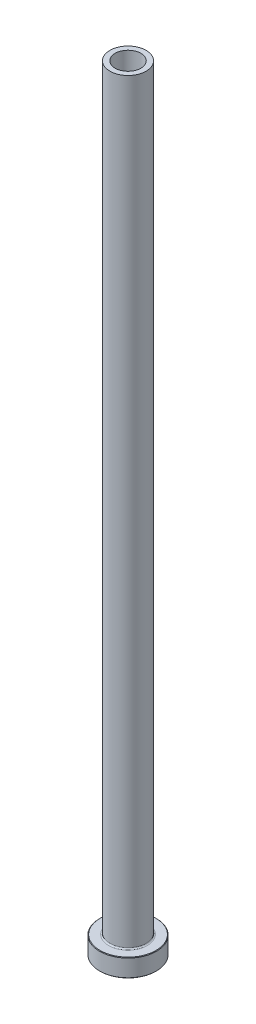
ISO-10303-21;
HEADER;
FILE_DESCRIPTION(('STEP AP214'),'2;1');
FILE_NAME('part.step','',(''),(''),'','','');
FILE_SCHEMA(('AUTOMOTIVE_DESIGN { 1 0 10303 214 1 1 1 1 }'));
ENDSEC;
DATA;
#1=APPLICATION_CONTEXT('core data for automotive mechanical design processes');
#2=APPLICATION_PROTOCOL_DEFINITION('international standard','automotive_design',2000,#1);
#3=PRODUCT_CONTEXT('',#1,'mechanical');
#4=PRODUCT('Part','Part','',(#3));
#5=PRODUCT_RELATED_PRODUCT_CATEGORY('part','',(#4));
#6=PRODUCT_DEFINITION_FORMATION('','',#4);
#7=PRODUCT_DEFINITION_CONTEXT('part definition',#1,'design');
#8=PRODUCT_DEFINITION('design','',#6,#7);
#9=PRODUCT_DEFINITION_SHAPE('','',#8);
#10=(LENGTH_UNIT() NAMED_UNIT(*) SI_UNIT(.MILLI.,.METRE.));
#11=(NAMED_UNIT(*) PLANE_ANGLE_UNIT() SI_UNIT($,.RADIAN.));
#12=(NAMED_UNIT(*) SI_UNIT($,.STERADIAN.) SOLID_ANGLE_UNIT());
#13=UNCERTAINTY_MEASURE_WITH_UNIT(LENGTH_MEASURE(1.E-05),#10,'distance_accuracy_value','');
#14=(GEOMETRIC_REPRESENTATION_CONTEXT(3) GLOBAL_UNCERTAINTY_ASSIGNED_CONTEXT((#13)) GLOBAL_UNIT_ASSIGNED_CONTEXT((#10,
#11,#12)) REPRESENTATION_CONTEXT('',''));
#15=CARTESIAN_POINT('',(0.,0.,0.));
#16=DIRECTION('',(0.,0.,1.));
#17=DIRECTION('',(1.,0.,0.));
#18=AXIS2_PLACEMENT_3D('',#15,#16,#17);
#19=CARTESIAN_POINT('',(0.,92.1876809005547,0.));
#20=DIRECTION('',(0.,1.,0.));
#21=DIRECTION('',(0.,0.,1.));
#22=AXIS2_PLACEMENT_3D('',#19,#20,#21);
#23=CYLINDRICAL_SURFACE('',#22,5.00000000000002);
#24=CARTESIAN_POINT('',(0.,300.,0.));
#25=DIRECTION('',(0.,1.,0.));
#26=DIRECTION('',(0.,0.,1.));
#27=AXIS2_PLACEMENT_3D('',#24,#25,#26);
#28=CIRCLE('',#27,5.00000000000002);
#29=CARTESIAN_POINT('',(0.,300.,5.00000000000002));
#30=VERTEX_POINT('',#29);
#31=EDGE_CURVE('E62',#30,#30,#28,.T.);
#32=ORIENTED_EDGE('',*,*,#31,.T.);
#33=EDGE_LOOP('',(#32));
#34=FACE_BOUND('',#33,.T.);
#35=CARTESIAN_POINT('',(0.,255.,0.));
#36=DIRECTION('',(0.,1.,0.));
#37=DIRECTION('',(0.,0.,1.));
#38=AXIS2_PLACEMENT_3D('',#35,#36,#37);
#39=CIRCLE('',#38,5.00000000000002);
#40=CARTESIAN_POINT('',(0.,255.,5.00000000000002));
#41=VERTEX_POINT('',#40);
#42=EDGE_CURVE('E71',#41,#41,#39,.T.);
#43=ORIENTED_EDGE('',*,*,#42,.F.);
#44=EDGE_LOOP('',(#43));
#45=FACE_BOUND('',#44,.T.);
#46=ADVANCED_FACE('F30',(#34,#45),#23,.F.);
#47=CARTESIAN_POINT('',(-5.00000000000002,300.,0.));
#48=DIRECTION('',(0.,1.,0.));
#49=DIRECTION('',(0.,0.,1.));
#50=AXIS2_PLACEMENT_3D('',#47,#48,#49);
#51=PLANE('',#50);
#52=CARTESIAN_POINT('',(0.,300.,0.));
#53=DIRECTION('',(0.,1.,0.));
#54=DIRECTION('',(0.,0.,1.));
#55=AXIS2_PLACEMENT_3D('',#52,#53,#54);
#56=CIRCLE('',#55,7.00000000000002);
#57=CARTESIAN_POINT('',(0.,300.,7.00000000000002));
#58=VERTEX_POINT('',#57);
#59=EDGE_CURVE('E65',#58,#58,#56,.T.);
#60=ORIENTED_EDGE('',*,*,#59,.T.);
#61=EDGE_LOOP('',(#60));
#62=FACE_BOUND('',#61,.T.);
#63=ORIENTED_EDGE('',*,*,#31,.F.);
#64=EDGE_LOOP('',(#63));
#65=FACE_BOUND('',#64,.T.);
#66=ADVANCED_FACE('F79',(#62,#65),#51,.T.);
#67=CARTESIAN_POINT('',(0.,92.1876809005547,0.));
#68=DIRECTION('',(0.,1.,0.));
#69=DIRECTION('',(0.,0.,1.));
#70=AXIS2_PLACEMENT_3D('',#67,#68,#69);
#71=CYLINDRICAL_SURFACE('',#70,7.00000000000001);
#72=CARTESIAN_POINT('',(0.,7.50000000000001,0.));
#73=DIRECTION('',(0.,1.,0.));
#74=DIRECTION('',(0.,0.,1.));
#75=AXIS2_PLACEMENT_3D('',#72,#73,#74);
#76=CIRCLE('',#75,7.00000000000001);
#77=CARTESIAN_POINT('',(0.,7.50000000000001,7.00000000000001));
#78=VERTEX_POINT('',#77);
#79=EDGE_CURVE('E59',#78,#78,#76,.T.);
#80=ORIENTED_EDGE('',*,*,#79,.T.);
#81=EDGE_LOOP('',(#80));
#82=FACE_BOUND('',#81,.T.);
#83=ORIENTED_EDGE('',*,*,#59,.F.);
#84=EDGE_LOOP('',(#83));
#85=FACE_BOUND('',#84,.T.);
#86=ADVANCED_FACE('F85',(#82,#85),#71,.T.);
#87=CARTESIAN_POINT('',(-6.99999999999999,7.,0.));
#88=DIRECTION('',(0.,1.,0.));
#89=DIRECTION('',(0.,0.,1.));
#90=AXIS2_PLACEMENT_3D('',#87,#88,#89);
#91=PLANE('',#90);
#92=CARTESIAN_POINT('',(0.,7.,0.));
#93=DIRECTION('',(0.,1.,0.));
#94=DIRECTION('',(0.,0.,1.));
#95=AXIS2_PLACEMENT_3D('',#92,#93,#94);
#96=CIRCLE('',#95,10.8);
#97=CARTESIAN_POINT('',(0.,7.,-10.8));
#98=VERTEX_POINT('',#97);
#99=EDGE_CURVE('E53',#98,#98,#96,.T.);
#100=ORIENTED_EDGE('',*,*,#99,.T.);
#101=EDGE_LOOP('',(#100));
#102=FACE_BOUND('',#101,.T.);
#103=CARTESIAN_POINT('',(0.,7.,0.));
#104=DIRECTION('',(0.,1.,0.));
#105=DIRECTION('',(0.,0.,1.));
#106=AXIS2_PLACEMENT_3D('',#103,#104,#105);
#107=CIRCLE('',#106,7.50000000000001);
#108=CARTESIAN_POINT('',(0.,7.,7.50000000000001));
#109=VERTEX_POINT('',#108);
#110=EDGE_CURVE('E56',#109,#109,#107,.F.);
#111=ORIENTED_EDGE('',*,*,#110,.T.);
#112=EDGE_LOOP('',(#111));
#113=FACE_BOUND('',#112,.T.);
#114=ADVANCED_FACE('F111',(#102,#113),#91,.T.);
#115=CARTESIAN_POINT('',(0.,92.1876809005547,0.));
#116=DIRECTION('',(0.,1.,0.));
#117=DIRECTION('',(0.,0.,1.));
#118=AXIS2_PLACEMENT_3D('',#115,#116,#117);
#119=CYLINDRICAL_SURFACE('',#118,11.);
#120=CARTESIAN_POINT('',(0.,6.80000000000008,0.));
#121=DIRECTION('',(0.,1.,0.));
#122=DIRECTION('',(0.,0.,1.));
#123=AXIS2_PLACEMENT_3D('',#120,#121,#122);
#124=CIRCLE('',#123,11.);
#125=CARTESIAN_POINT('',(0.,6.80000000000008,-11.));
#126=VERTEX_POINT('',#125);
#127=EDGE_CURVE('E45',#126,#126,#124,.F.);
#128=ORIENTED_EDGE('',*,*,#127,.T.);
#129=EDGE_LOOP('',(#128));
#130=FACE_BOUND('',#129,.T.);
#131=CARTESIAN_POINT('',(0.,0.200000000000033,0.));
#132=DIRECTION('',(0.,-1.,0.));
#133=DIRECTION('',(0.,0.,-1.));
#134=AXIS2_PLACEMENT_3D('',#131,#132,#133);
#135=CIRCLE('',#134,11.);
#136=CARTESIAN_POINT('',(0.,0.200000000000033,-11.));
#137=VERTEX_POINT('',#136);
#138=EDGE_CURVE('E50',#137,#137,#135,.F.);
#139=ORIENTED_EDGE('',*,*,#138,.T.);
#140=EDGE_LOOP('',(#139));
#141=FACE_BOUND('',#140,.T.);
#142=ADVANCED_FACE('F108',(#130,#141),#119,.T.);
#143=CARTESIAN_POINT('',(-11.,0.,0.));
#144=DIRECTION('',(0.,-1.,0.));
#145=DIRECTION('',(0.,0.,-1.));
#146=AXIS2_PLACEMENT_3D('',#143,#144,#145);
#147=PLANE('',#146);
#148=CARTESIAN_POINT('',(0.,0.,0.));
#149=DIRECTION('',(0.,-1.,0.));
#150=DIRECTION('',(0.,0.,-1.));
#151=AXIS2_PLACEMENT_3D('',#148,#149,#150);
#152=CIRCLE('',#151,5.75000000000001);
#153=CARTESIAN_POINT('',(0.,0.,-5.75000000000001));
#154=VERTEX_POINT('',#153);
#155=EDGE_CURVE('E37',#154,#154,#152,.F.);
#156=ORIENTED_EDGE('',*,*,#155,.T.);
#157=EDGE_LOOP('',(#156));
#158=FACE_BOUND('',#157,.T.);
#159=CARTESIAN_POINT('',(0.,0.,0.));
#160=DIRECTION('',(0.,-1.,0.));
#161=DIRECTION('',(0.,0.,-1.));
#162=AXIS2_PLACEMENT_3D('',#159,#160,#161);
#163=CIRCLE('',#162,10.8);
#164=CARTESIAN_POINT('',(0.,0.,-10.8));
#165=VERTEX_POINT('',#164);
#166=EDGE_CURVE('E41',#165,#165,#163,.T.);
#167=ORIENTED_EDGE('',*,*,#166,.T.);
#168=EDGE_LOOP('',(#167));
#169=FACE_BOUND('',#168,.T.);
#170=ADVANCED_FACE('F110',(#158,#169),#147,.T.);
#171=CARTESIAN_POINT('',(0.,92.1876809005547,0.));
#172=DIRECTION('',(0.,1.,0.));
#173=DIRECTION('',(0.,0.,1.));
#174=AXIS2_PLACEMENT_3D('',#171,#172,#173);
#175=CYLINDRICAL_SURFACE('',#174,5.25000000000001);
#176=CARTESIAN_POINT('',(0.,0.499999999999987,0.));
#177=DIRECTION('',(0.,-1.,0.));
#178=DIRECTION('',(0.,0.,-1.));
#179=AXIS2_PLACEMENT_3D('',#176,#177,#178);
#180=CIRCLE('',#179,5.25000000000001);
#181=CARTESIAN_POINT('',(0.,0.499999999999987,-5.25000000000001));
#182=VERTEX_POINT('',#181);
#183=EDGE_CURVE('E10',#182,#182,#180,.T.);
#184=ORIENTED_EDGE('',*,*,#183,.T.);
#185=EDGE_LOOP('',(#184));
#186=FACE_BOUND('',#185,.T.);
#187=CARTESIAN_POINT('',(0.,243.,0.));
#188=DIRECTION('',(0.,1.,0.));
#189=DIRECTION('',(0.,0.,1.));
#190=AXIS2_PLACEMENT_3D('',#187,#188,#189);
#191=CIRCLE('',#190,5.25000000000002);
#192=CARTESIAN_POINT('',(0.,243.,5.25000000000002));
#193=VERTEX_POINT('',#192);
#194=EDGE_CURVE('E68',#193,#193,#191,.T.);
#195=ORIENTED_EDGE('',*,*,#194,.T.);
#196=EDGE_LOOP('',(#195));
#197=FACE_BOUND('',#196,.T.);
#198=ADVANCED_FACE('F118',(#186,#197),#175,.F.);
#199=CARTESIAN_POINT('',(0.,243.,0.));
#200=DIRECTION('',(0.,-1.,0.));
#201=DIRECTION('',(0.,0.,-1.));
#202=AXIS2_PLACEMENT_3D('',#199,#200,#201);
#203=CONICAL_SURFACE('',#202,5.25000000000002,0.0208303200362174);
#204=ORIENTED_EDGE('',*,*,#42,.T.);
#205=EDGE_LOOP('',(#204));
#206=FACE_BOUND('',#205,.T.);
#207=ORIENTED_EDGE('',*,*,#194,.F.);
#208=EDGE_LOOP('',(#207));
#209=FACE_BOUND('',#208,.T.);
#210=ADVANCED_FACE('F75',(#206,#209),#203,.F.);
#211=CARTESIAN_POINT('',(0.,7.50000000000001,0.));
#212=DIRECTION('',(0.,1.,0.));
#213=DIRECTION('',(0.,0.,1.));
#214=AXIS2_PLACEMENT_3D('',#211,#212,#213);
#215=TOROIDAL_SURFACE('',#214,7.50000000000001,0.5);
#216=ORIENTED_EDGE('',*,*,#110,.F.);
#217=EDGE_LOOP('',(#216));
#218=FACE_BOUND('',#217,.T.);
#219=ORIENTED_EDGE('',*,*,#79,.F.);
#220=EDGE_LOOP('',(#219));
#221=FACE_BOUND('',#220,.T.);
#222=ADVANCED_FACE('F90',(#218,#221),#215,.F.);
#223=CARTESIAN_POINT('',(0.,7.00000000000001,0.));
#224=DIRECTION('',(0.,-1.,0.));
#225=DIRECTION('',(0.,0.,-1.));
#226=AXIS2_PLACEMENT_3D('',#223,#224,#225);
#227=CONICAL_SURFACE('',#226,10.8,0.785398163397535);
#228=CARTESIAN_POINT('',(0.,6.80000000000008,-11.));
#229=CARTESIAN_POINT('',(0.,6.80208333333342,-10.9979166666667));
#230=CARTESIAN_POINT('',(0.,6.80416666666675,-10.9958333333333));
#231=CARTESIAN_POINT('',(0.,6.80833333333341,-10.9916666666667));
#232=CARTESIAN_POINT('',(0.,6.81041666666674,-10.9895833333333));
#233=CARTESIAN_POINT('',(0.,6.81458333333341,-10.9854166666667));
#234=CARTESIAN_POINT('',(0.,6.81666666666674,-10.9833333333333));
#235=CARTESIAN_POINT('',(0.,6.82083333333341,-10.9791666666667));
#236=CARTESIAN_POINT('',(0.,6.82291666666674,-10.9770833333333));
#237=CARTESIAN_POINT('',(0.,6.82708333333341,-10.9729166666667));
#238=CARTESIAN_POINT('',(0.,6.82916666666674,-10.9708333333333));
#239=CARTESIAN_POINT('',(0.,6.8333333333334,-10.9666666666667));
#240=CARTESIAN_POINT('',(0.,6.83541666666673,-10.9645833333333));
#241=CARTESIAN_POINT('',(0.,6.8395833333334,-10.9604166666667));
#242=CARTESIAN_POINT('',(0.,6.84166666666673,-10.9583333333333));
#243=CARTESIAN_POINT('',(0.,6.8458333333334,-10.9541666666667));
#244=CARTESIAN_POINT('',(0.,6.84791666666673,-10.9520833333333));
#245=CARTESIAN_POINT('',(0.,6.8520833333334,-10.9479166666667));
#246=CARTESIAN_POINT('',(0.,6.85416666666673,-10.9458333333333));
#247=CARTESIAN_POINT('',(0.,6.85833333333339,-10.9416666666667));
#248=CARTESIAN_POINT('',(0.,6.86041666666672,-10.9395833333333));
#249=CARTESIAN_POINT('',(0.,6.86458333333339,-10.9354166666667));
#250=CARTESIAN_POINT('',(0.,6.86666666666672,-10.9333333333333));
#251=CARTESIAN_POINT('',(0.,6.87083333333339,-10.9291666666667));
#252=CARTESIAN_POINT('',(0.,6.87291666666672,-10.9270833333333));
#253=CARTESIAN_POINT('',(0.,6.87708333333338,-10.9229166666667));
#254=CARTESIAN_POINT('',(0.,6.87916666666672,-10.9208333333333));
#255=CARTESIAN_POINT('',(0.,6.88333333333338,-10.9166666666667));
#256=CARTESIAN_POINT('',(0.,6.88541666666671,-10.9145833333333));
#257=CARTESIAN_POINT('',(0.,6.88958333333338,-10.9104166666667));
#258=CARTESIAN_POINT('',(0.,6.89166666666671,-10.9083333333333));
#259=CARTESIAN_POINT('',(0.,6.89583333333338,-10.9041666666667));
#260=CARTESIAN_POINT('',(0.,6.89791666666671,-10.9020833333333));
#261=CARTESIAN_POINT('',(0.,6.90208333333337,-10.8979166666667));
#262=CARTESIAN_POINT('',(0.,6.90416666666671,-10.8958333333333));
#263=CARTESIAN_POINT('',(0.,6.90833333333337,-10.8916666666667));
#264=CARTESIAN_POINT('',(0.,6.9104166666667,-10.8895833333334));
#265=CARTESIAN_POINT('',(0.,6.91458333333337,-10.8854166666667));
#266=CARTESIAN_POINT('',(0.,6.9166666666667,-10.8833333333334));
#267=CARTESIAN_POINT('',(0.,6.92083333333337,-10.8791666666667));
#268=CARTESIAN_POINT('',(0.,6.9229166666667,-10.8770833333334));
#269=CARTESIAN_POINT('',(0.,6.92708333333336,-10.8729166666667));
#270=CARTESIAN_POINT('',(0.,6.9291666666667,-10.8708333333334));
#271=CARTESIAN_POINT('',(0.,6.93333333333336,-10.8666666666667));
#272=CARTESIAN_POINT('',(0.,6.93541666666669,-10.8645833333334));
#273=CARTESIAN_POINT('',(0.,6.93958333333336,-10.8604166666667));
#274=CARTESIAN_POINT('',(0.,6.94166666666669,-10.8583333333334));
#275=CARTESIAN_POINT('',(0.,6.94583333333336,-10.8541666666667));
#276=CARTESIAN_POINT('',(0.,6.94791666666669,-10.8520833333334));
#277=CARTESIAN_POINT('',(0.,6.95208333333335,-10.8479166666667));
#278=CARTESIAN_POINT('',(0.,6.95416666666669,-10.8458333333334));
#279=CARTESIAN_POINT('',(0.,6.95833333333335,-10.8416666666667));
#280=CARTESIAN_POINT('',(0.,6.96041666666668,-10.8395833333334));
#281=CARTESIAN_POINT('',(0.,6.96458333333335,-10.8354166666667));
#282=CARTESIAN_POINT('',(0.,6.96666666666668,-10.8333333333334));
#283=CARTESIAN_POINT('',(0.,6.97083333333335,-10.8291666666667));
#284=CARTESIAN_POINT('',(0.,6.97291666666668,-10.8270833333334));
#285=CARTESIAN_POINT('',(0.,6.97708333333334,-10.8229166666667));
#286=CARTESIAN_POINT('',(0.,6.97916666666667,-10.8208333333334));
#287=CARTESIAN_POINT('',(0.,6.98333333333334,-10.8166666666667));
#288=CARTESIAN_POINT('',(0.,6.98541666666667,-10.8145833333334));
#289=CARTESIAN_POINT('',(0.,6.98958333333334,-10.8104166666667));
#290=CARTESIAN_POINT('',(0.,6.99166666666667,-10.8083333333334));
#291=CARTESIAN_POINT('',(0.,6.99583333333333,-10.8041666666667));
#292=CARTESIAN_POINT('',(0.,6.99791666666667,-10.8020833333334));
#293=CARTESIAN_POINT('',(0.,7.,-10.8));
#294=B_SPLINE_CURVE_WITH_KNOTS('',3,(#228,#229,#230,#231,#232,#233,#234,#235,#236,#237,#238,
#239,#240,#241,#242,#243,#244,#245,#246,#247,#248,#249,#250,#251,#252,#253,#254,#255,#256,#257,
#258,#259,#260,#261,#262,#263,#264,#265,#266,#267,#268,#269,#270,#271,#272,#273,#274,#275,#276,
#277,#278,#279,#280,#281,#282,#283,#284,#285,#286,#287,#288,#289,#290,#291,#292,#293),
.UNSPECIFIED.,.F.,.F.,(4,2,2,2,2,2,2,2,2,2,2,2,2,2,2,2,2,2,2,2,2,2,2,2,2,2,2,2,2,2,2,2,4),(0.,
0.00883883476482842,0.0176776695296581,0.0265165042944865,0.0353553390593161,0.0441941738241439,
0.0530330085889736,0.061871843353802,0.0707106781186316,0.07954951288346,0.0883883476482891,
0.0972271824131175,0.106066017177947,0.114904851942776,0.123743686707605,0.132582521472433,
0.141421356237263,0.150260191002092,0.159099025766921,0.16793786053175,0.176776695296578,
0.185615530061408,0.194454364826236,0.203293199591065,0.212132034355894,0.220970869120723,
0.229809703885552,0.238648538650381,0.247487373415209,0.256326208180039,0.265165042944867,
0.274003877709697,0.282842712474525),.UNSPECIFIED.);
#295=EDGE_CURVE('BSEAM93',#126,#98,#294,.T.);
#296=ORIENTED_EDGE('',*,*,#127,.F.);
#297=ORIENTED_EDGE('',*,*,#99,.F.);
#298=ORIENTED_EDGE('',*,*,#295,.T.);
#299=ORIENTED_EDGE('',*,*,#295,.F.);
#300=EDGE_LOOP('',(#296,#298,#297,#299));
#301=FACE_BOUND('',#300,.T.);
#302=ADVANCED_FACE('F93',(#301),#227,.T.);
#303=CARTESIAN_POINT('',(0.,0.200000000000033,0.));
#304=DIRECTION('',(0.,1.,0.));
#305=DIRECTION('',(0.,0.,1.));
#306=AXIS2_PLACEMENT_3D('',#303,#304,#305);
#307=CONICAL_SURFACE('',#306,11.,0.785398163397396);
#308=ORIENTED_EDGE('',*,*,#166,.F.);
#309=EDGE_LOOP('',(#308));
#310=FACE_BOUND('',#309,.T.);
#311=ORIENTED_EDGE('',*,*,#138,.F.);
#312=EDGE_LOOP('',(#311));
#313=FACE_BOUND('',#312,.T.);
#314=ADVANCED_FACE('F96',(#310,#313),#307,.T.);
#315=CARTESIAN_POINT('',(0.,0.,0.));
#316=DIRECTION('',(0.,-1.,0.));
#317=DIRECTION('',(0.,0.,-1.));
#318=AXIS2_PLACEMENT_3D('',#315,#316,#317);
#319=CONICAL_SURFACE('',#318,5.75000000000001,0.785398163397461);
#320=ORIENTED_EDGE('',*,*,#183,.F.);
#321=EDGE_LOOP('',(#320));
#322=FACE_BOUND('',#321,.T.);
#323=ORIENTED_EDGE('',*,*,#155,.F.);
#324=EDGE_LOOP('',(#323));
#325=FACE_BOUND('',#324,.T.);
#326=ADVANCED_FACE('F32',(#322,#325),#319,.F.);
#327=CLOSED_SHELL('',(#46,#66,#86,#114,#142,#170,#198,#210,#222,#302,#314,#326));
#328=MANIFOLD_SOLID_BREP('B2',#327);
#329=ADVANCED_BREP_SHAPE_REPRESENTATION('',(#18,#328),#14);
#330=SHAPE_DEFINITION_REPRESENTATION(#9,#329);
ENDSEC;
END-ISO-10303-21;
